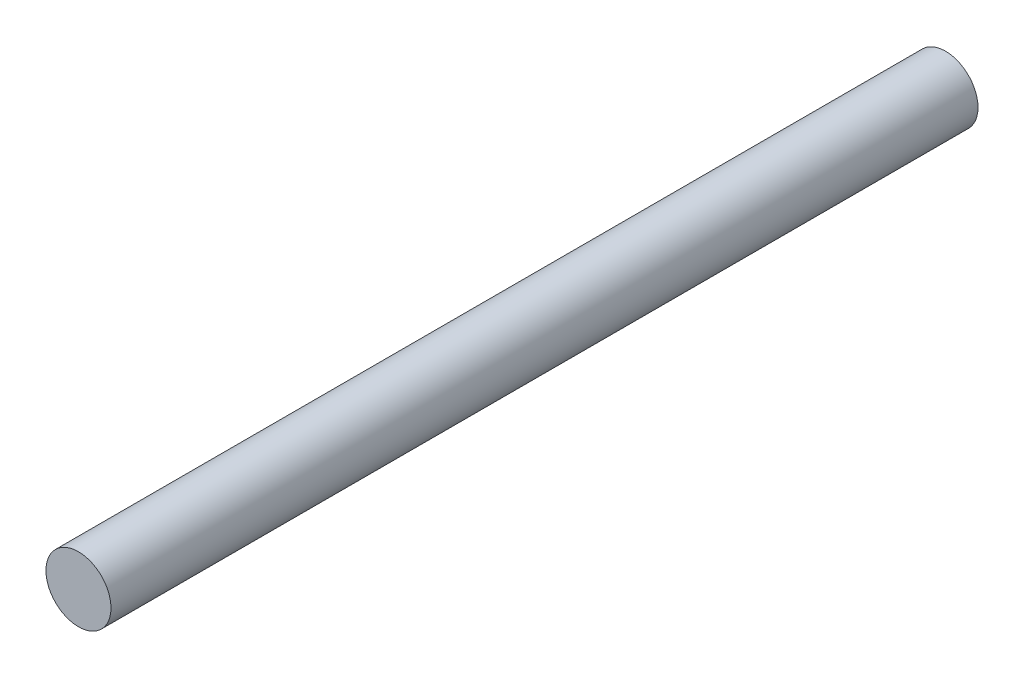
from build123d import *

# Parameters (mm, degrees)
ESQUISSE1_R      = 6
EXTRUSION1_DEPTH = 160


with BuildPart() as part:
    # Esquisse1 → Extrusion1 (new body)
    with BuildSketch(Plane.XY):
        Circle(ESQUISSE1_R)
    extrude(amount=EXTRUSION1_DEPTH)


solid = part.part
